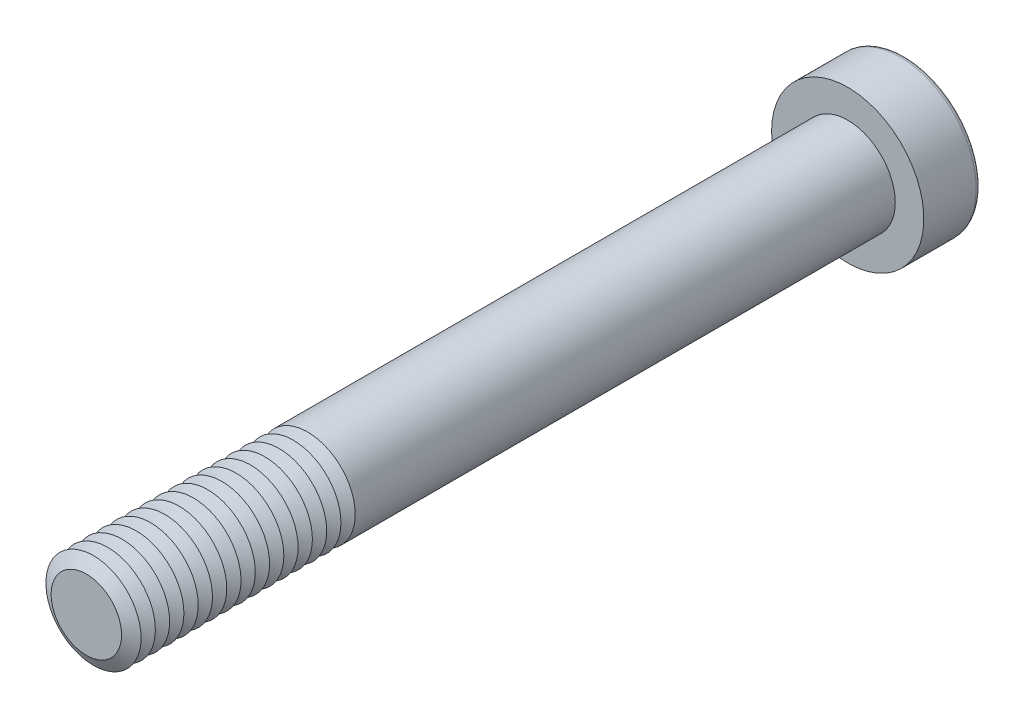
ISO-10303-21;
HEADER;
FILE_DESCRIPTION(('STEP AP214'),'2;1');
FILE_NAME('part.step','',(''),(''),'','','');
FILE_SCHEMA(('AUTOMOTIVE_DESIGN { 1 0 10303 214 1 1 1 1 }'));
ENDSEC;
DATA;
#1=APPLICATION_CONTEXT('core data for automotive mechanical design processes');
#2=APPLICATION_PROTOCOL_DEFINITION('international standard','automotive_design',2000,#1);
#3=PRODUCT_CONTEXT('',#1,'mechanical');
#4=PRODUCT('Part','Part','',(#3));
#5=PRODUCT_RELATED_PRODUCT_CATEGORY('part','',(#4));
#6=PRODUCT_DEFINITION_FORMATION('','',#4);
#7=PRODUCT_DEFINITION_CONTEXT('part definition',#1,'design');
#8=PRODUCT_DEFINITION('design','',#6,#7);
#9=PRODUCT_DEFINITION_SHAPE('','',#8);
#10=(LENGTH_UNIT() NAMED_UNIT(*) SI_UNIT(.MILLI.,.METRE.));
#11=(NAMED_UNIT(*) PLANE_ANGLE_UNIT() SI_UNIT($,.RADIAN.));
#12=(NAMED_UNIT(*) SI_UNIT($,.STERADIAN.) SOLID_ANGLE_UNIT());
#13=UNCERTAINTY_MEASURE_WITH_UNIT(LENGTH_MEASURE(1.E-05),#10,'distance_accuracy_value','');
#14=(GEOMETRIC_REPRESENTATION_CONTEXT(3) GLOBAL_UNCERTAINTY_ASSIGNED_CONTEXT((#13)) GLOBAL_UNIT_ASSIGNED_CONTEXT((#10,
#11,#12)) REPRESENTATION_CONTEXT('',''));
#15=CARTESIAN_POINT('',(0.,0.,0.));
#16=DIRECTION('',(0.,0.,1.));
#17=DIRECTION('',(1.,0.,0.));
#18=AXIS2_PLACEMENT_3D('',#15,#16,#17);
#19=CARTESIAN_POINT('',(0.,0.,74.75));
#20=DIRECTION('',(0.,0.,1.));
#21=DIRECTION('',(1.,0.,0.));
#22=AXIS2_PLACEMENT_3D('',#19,#20,#21);
#23=CONICAL_SURFACE('',#22,5.,1.0471975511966);
#24=CARTESIAN_POINT('',(0.,0.,74.));
#25=DIRECTION('',(0.,0.,1.));
#26=DIRECTION('',(1.,0.,0.));
#27=AXIS2_PLACEMENT_3D('',#24,#25,#26);
#28=CIRCLE('',#27,3.70096189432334);
#29=CARTESIAN_POINT('',(3.70096189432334,0.,74.));
#30=VERTEX_POINT('',#29);
#31=EDGE_CURVE('E314',#30,#30,#28,.T.);
#32=ORIENTED_EDGE('',*,*,#31,.T.);
#33=EDGE_LOOP('',(#32));
#34=FACE_BOUND('',#33,.T.);
#35=CARTESIAN_POINT('',(0.,0.,74.75));
#36=DIRECTION('',(0.,0.,1.));
#37=DIRECTION('',(1.,0.,0.));
#38=AXIS2_PLACEMENT_3D('',#35,#36,#37);
#39=CIRCLE('',#38,5.);
#40=CARTESIAN_POINT('',(5.,0.,74.75));
#41=VERTEX_POINT('',#40);
#42=EDGE_CURVE('E317',#41,#41,#39,.T.);
#43=ORIENTED_EDGE('',*,*,#42,.F.);
#44=EDGE_LOOP('',(#43));
#45=FACE_BOUND('',#44,.T.);
#46=ADVANCED_FACE('F39',(#34,#45),#23,.T.);
#47=CARTESIAN_POINT('',(0.,0.,74.));
#48=DIRECTION('',(0.,0.,-1.));
#49=DIRECTION('',(-1.,0.,0.));
#50=AXIS2_PLACEMENT_3D('',#47,#48,#49);
#51=CONICAL_SURFACE('',#50,3.70096189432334,1.0471975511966);
#52=CARTESIAN_POINT('',(0.,0.,73.25));
#53=DIRECTION('',(0.,0.,1.));
#54=DIRECTION('',(1.,0.,0.));
#55=AXIS2_PLACEMENT_3D('',#52,#53,#54);
#56=CIRCLE('',#55,5.);
#57=CARTESIAN_POINT('',(5.,0.,73.25));
#58=VERTEX_POINT('',#57);
#59=EDGE_CURVE('E325',#58,#58,#56,.T.);
#60=ORIENTED_EDGE('',*,*,#59,.T.);
#61=EDGE_LOOP('',(#60));
#62=FACE_BOUND('',#61,.T.);
#63=ORIENTED_EDGE('',*,*,#31,.F.);
#64=EDGE_LOOP('',(#63));
#65=FACE_BOUND('',#64,.T.);
#66=ADVANCED_FACE('F245',(#62,#65),#51,.T.);
#67=CARTESIAN_POINT('',(0.,0.,80.));
#68=DIRECTION('',(0.,0.,1.));
#69=DIRECTION('',(1.,0.,0.));
#70=AXIS2_PLACEMENT_3D('',#67,#68,#69);
#71=PLANE('',#70);
#72=CARTESIAN_POINT('',(0.,0.,80.));
#73=DIRECTION('',(0.,0.,1.));
#74=DIRECTION('',(1.,0.,0.));
#75=AXIS2_PLACEMENT_3D('',#72,#73,#74);
#76=CIRCLE('',#75,3.70096189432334);
#77=CARTESIAN_POINT('',(3.70096189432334,0.,80.));
#78=VERTEX_POINT('',#77);
#79=EDGE_CURVE('E174',#78,#78,#76,.T.);
#80=ORIENTED_EDGE('',*,*,#79,.T.);
#81=EDGE_LOOP('',(#80));
#82=FACE_BOUND('',#81,.T.);
#83=ADVANCED_FACE('F251',(#82),#71,.T.);
#84=CARTESIAN_POINT('',(0.,0.,80.));
#85=DIRECTION('',(0.,0.,-1.));
#86=DIRECTION('',(-1.,0.,0.));
#87=AXIS2_PLACEMENT_3D('',#84,#85,#86);
#88=CONICAL_SURFACE('',#87,3.70096189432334,1.0471975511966);
#89=CARTESIAN_POINT('',(0.,0.,79.25));
#90=DIRECTION('',(0.,0.,1.));
#91=DIRECTION('',(1.,0.,0.));
#92=AXIS2_PLACEMENT_3D('',#89,#90,#91);
#93=CIRCLE('',#92,5.);
#94=CARTESIAN_POINT('',(5.,0.,79.25));
#95=VERTEX_POINT('',#94);
#96=EDGE_CURVE('E291',#95,#95,#93,.T.);
#97=ORIENTED_EDGE('',*,*,#96,.T.);
#98=EDGE_LOOP('',(#97));
#99=FACE_BOUND('',#98,.T.);
#100=ORIENTED_EDGE('',*,*,#79,.F.);
#101=EDGE_LOOP('',(#100));
#102=FACE_BOUND('',#101,.T.);
#103=ADVANCED_FACE('F199',(#99,#102),#88,.T.);
#104=CARTESIAN_POINT('',(0.,0.,79.25));
#105=DIRECTION('',(0.,0.,1.));
#106=DIRECTION('',(1.,0.,0.));
#107=AXIS2_PLACEMENT_3D('',#104,#105,#106);
#108=CONICAL_SURFACE('',#107,5.,1.0471975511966);
#109=CARTESIAN_POINT('',(0.,0.,78.5));
#110=DIRECTION('',(0.,0.,1.));
#111=DIRECTION('',(1.,0.,0.));
#112=AXIS2_PLACEMENT_3D('',#109,#110,#111);
#113=CIRCLE('',#112,3.70096189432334);
#114=CARTESIAN_POINT('',(3.70096189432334,0.,78.5));
#115=VERTEX_POINT('',#114);
#116=EDGE_CURVE('E288',#115,#115,#113,.T.);
#117=ORIENTED_EDGE('',*,*,#116,.T.);
#118=EDGE_LOOP('',(#117));
#119=FACE_BOUND('',#118,.T.);
#120=ORIENTED_EDGE('',*,*,#96,.F.);
#121=EDGE_LOOP('',(#120));
#122=FACE_BOUND('',#121,.T.);
#123=ADVANCED_FACE('F277',(#119,#122),#108,.T.);
#124=CARTESIAN_POINT('',(0.,0.,78.5));
#125=DIRECTION('',(0.,0.,-1.));
#126=DIRECTION('',(-1.,0.,0.));
#127=AXIS2_PLACEMENT_3D('',#124,#125,#126);
#128=CONICAL_SURFACE('',#127,3.70096189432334,1.0471975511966);
#129=CARTESIAN_POINT('',(0.,0.,77.75));
#130=DIRECTION('',(0.,0.,1.));
#131=DIRECTION('',(1.,0.,0.));
#132=AXIS2_PLACEMENT_3D('',#129,#130,#131);
#133=CIRCLE('',#132,5.);
#134=CARTESIAN_POINT('',(5.,0.,77.75));
#135=VERTEX_POINT('',#134);
#136=EDGE_CURVE('E300',#135,#135,#133,.T.);
#137=ORIENTED_EDGE('',*,*,#136,.T.);
#138=EDGE_LOOP('',(#137));
#139=FACE_BOUND('',#138,.T.);
#140=ORIENTED_EDGE('',*,*,#116,.F.);
#141=EDGE_LOOP('',(#140));
#142=FACE_BOUND('',#141,.T.);
#143=ADVANCED_FACE('F274',(#139,#142),#128,.T.);
#144=CARTESIAN_POINT('',(0.,0.,77.75));
#145=DIRECTION('',(0.,0.,1.));
#146=DIRECTION('',(1.,0.,0.));
#147=AXIS2_PLACEMENT_3D('',#144,#145,#146);
#148=CONICAL_SURFACE('',#147,5.,1.0471975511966);
#149=CARTESIAN_POINT('',(0.,0.,77.));
#150=DIRECTION('',(0.,0.,1.));
#151=DIRECTION('',(1.,0.,0.));
#152=AXIS2_PLACEMENT_3D('',#149,#150,#151);
#153=CIRCLE('',#152,3.70096189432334);
#154=CARTESIAN_POINT('',(3.70096189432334,0.,77.));
#155=VERTEX_POINT('',#154);
#156=EDGE_CURVE('E293',#155,#155,#153,.T.);
#157=ORIENTED_EDGE('',*,*,#156,.T.);
#158=EDGE_LOOP('',(#157));
#159=FACE_BOUND('',#158,.T.);
#160=ORIENTED_EDGE('',*,*,#136,.F.);
#161=EDGE_LOOP('',(#160));
#162=FACE_BOUND('',#161,.T.);
#163=ADVANCED_FACE('F270',(#159,#162),#148,.T.);
#164=CARTESIAN_POINT('',(0.,0.,77.));
#165=DIRECTION('',(0.,0.,-1.));
#166=DIRECTION('',(-1.,0.,0.));
#167=AXIS2_PLACEMENT_3D('',#164,#165,#166);
#168=CONICAL_SURFACE('',#167,3.70096189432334,1.0471975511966);
#169=CARTESIAN_POINT('',(0.,0.,76.25));
#170=DIRECTION('',(0.,0.,1.));
#171=DIRECTION('',(1.,0.,0.));
#172=AXIS2_PLACEMENT_3D('',#169,#170,#171);
#173=CIRCLE('',#172,5.);
#174=CARTESIAN_POINT('',(5.,0.,76.25));
#175=VERTEX_POINT('',#174);
#176=EDGE_CURVE('E310',#175,#175,#173,.T.);
#177=ORIENTED_EDGE('',*,*,#176,.T.);
#178=EDGE_LOOP('',(#177));
#179=FACE_BOUND('',#178,.T.);
#180=ORIENTED_EDGE('',*,*,#156,.F.);
#181=EDGE_LOOP('',(#180));
#182=FACE_BOUND('',#181,.T.);
#183=ADVANCED_FACE('F266',(#179,#182),#168,.T.);
#184=CARTESIAN_POINT('',(0.,0.,76.25));
#185=DIRECTION('',(0.,0.,1.));
#186=DIRECTION('',(1.,0.,0.));
#187=AXIS2_PLACEMENT_3D('',#184,#185,#186);
#188=CONICAL_SURFACE('',#187,5.,1.0471975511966);
#189=CARTESIAN_POINT('',(0.,0.,75.5));
#190=DIRECTION('',(0.,0.,1.));
#191=DIRECTION('',(1.,0.,0.));
#192=AXIS2_PLACEMENT_3D('',#189,#190,#191);
#193=CIRCLE('',#192,3.70096189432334);
#194=CARTESIAN_POINT('',(3.70096189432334,0.,75.5));
#195=VERTEX_POINT('',#194);
#196=EDGE_CURVE('E306',#195,#195,#193,.T.);
#197=ORIENTED_EDGE('',*,*,#196,.T.);
#198=EDGE_LOOP('',(#197));
#199=FACE_BOUND('',#198,.T.);
#200=ORIENTED_EDGE('',*,*,#176,.F.);
#201=EDGE_LOOP('',(#200));
#202=FACE_BOUND('',#201,.T.);
#203=ADVANCED_FACE('F262',(#199,#202),#188,.T.);
#204=CARTESIAN_POINT('',(0.,0.,75.5));
#205=DIRECTION('',(0.,0.,-1.));
#206=DIRECTION('',(-1.,0.,0.));
#207=AXIS2_PLACEMENT_3D('',#204,#205,#206);
#208=CONICAL_SURFACE('',#207,3.70096189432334,1.0471975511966);
#209=ORIENTED_EDGE('',*,*,#42,.T.);
#210=EDGE_LOOP('',(#209));
#211=FACE_BOUND('',#210,.T.);
#212=ORIENTED_EDGE('',*,*,#196,.F.);
#213=EDGE_LOOP('',(#212));
#214=FACE_BOUND('',#213,.T.);
#215=ADVANCED_FACE('F258',(#211,#214),#208,.T.);
#216=CARTESIAN_POINT('',(0.,0.,73.25));
#217=DIRECTION('',(0.,0.,1.));
#218=DIRECTION('',(1.,0.,0.));
#219=AXIS2_PLACEMENT_3D('',#216,#217,#218);
#220=CONICAL_SURFACE('',#219,5.,1.0471975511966);
#221=CARTESIAN_POINT('',(0.,0.,72.5));
#222=DIRECTION('',(0.,0.,1.));
#223=DIRECTION('',(1.,0.,0.));
#224=AXIS2_PLACEMENT_3D('',#221,#222,#223);
#225=CIRCLE('',#224,3.70096189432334);
#226=CARTESIAN_POINT('',(3.70096189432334,0.,72.5));
#227=VERTEX_POINT('',#226);
#228=EDGE_CURVE('E321',#227,#227,#225,.T.);
#229=ORIENTED_EDGE('',*,*,#228,.T.);
#230=EDGE_LOOP('',(#229));
#231=FACE_BOUND('',#230,.T.);
#232=ORIENTED_EDGE('',*,*,#59,.F.);
#233=EDGE_LOOP('',(#232));
#234=FACE_BOUND('',#233,.T.);
#235=ADVANCED_FACE('F261',(#231,#234),#220,.T.);
#236=CARTESIAN_POINT('',(0.,0.,72.5));
#237=DIRECTION('',(0.,0.,-1.));
#238=DIRECTION('',(-1.,0.,0.));
#239=AXIS2_PLACEMENT_3D('',#236,#237,#238);
#240=CONICAL_SURFACE('',#239,3.70096189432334,1.0471975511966);
#241=CARTESIAN_POINT('',(0.,0.,71.75));
#242=DIRECTION('',(0.,0.,1.));
#243=DIRECTION('',(1.,0.,0.));
#244=AXIS2_PLACEMENT_3D('',#241,#242,#243);
#245=CIRCLE('',#244,5.);
#246=CARTESIAN_POINT('',(5.,0.,71.75));
#247=VERTEX_POINT('',#246);
#248=EDGE_CURVE('E332',#247,#247,#245,.T.);
#249=ORIENTED_EDGE('',*,*,#248,.T.);
#250=EDGE_LOOP('',(#249));
#251=FACE_BOUND('',#250,.T.);
#252=ORIENTED_EDGE('',*,*,#228,.F.);
#253=EDGE_LOOP('',(#252));
#254=FACE_BOUND('',#253,.T.);
#255=ADVANCED_FACE('F495',(#251,#254),#240,.T.);
#256=CARTESIAN_POINT('',(0.,0.,71.75));
#257=DIRECTION('',(0.,0.,1.));
#258=DIRECTION('',(1.,0.,0.));
#259=AXIS2_PLACEMENT_3D('',#256,#257,#258);
#260=CONICAL_SURFACE('',#259,5.,1.0471975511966);
#261=CARTESIAN_POINT('',(0.,0.,71.));
#262=DIRECTION('',(0.,0.,1.));
#263=DIRECTION('',(1.,0.,0.));
#264=AXIS2_PLACEMENT_3D('',#261,#262,#263);
#265=CIRCLE('',#264,3.70096189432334);
#266=CARTESIAN_POINT('',(3.70096189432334,0.,71.));
#267=VERTEX_POINT('',#266);
#268=EDGE_CURVE('E328',#267,#267,#265,.T.);
#269=ORIENTED_EDGE('',*,*,#268,.T.);
#270=EDGE_LOOP('',(#269));
#271=FACE_BOUND('',#270,.T.);
#272=ORIENTED_EDGE('',*,*,#248,.F.);
#273=EDGE_LOOP('',(#272));
#274=FACE_BOUND('',#273,.T.);
#275=ADVANCED_FACE('F491',(#271,#274),#260,.T.);
#276=CARTESIAN_POINT('',(0.,0.,71.));
#277=DIRECTION('',(0.,0.,-1.));
#278=DIRECTION('',(-1.,0.,0.));
#279=AXIS2_PLACEMENT_3D('',#276,#277,#278);
#280=CONICAL_SURFACE('',#279,3.70096189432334,1.0471975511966);
#281=CARTESIAN_POINT('',(0.,0.,70.25));
#282=DIRECTION('',(0.,0.,1.));
#283=DIRECTION('',(1.,0.,0.));
#284=AXIS2_PLACEMENT_3D('',#281,#282,#283);
#285=CIRCLE('',#284,5.);
#286=CARTESIAN_POINT('',(5.,0.,70.25));
#287=VERTEX_POINT('',#286);
#288=EDGE_CURVE('E340',#287,#287,#285,.T.);
#289=ORIENTED_EDGE('',*,*,#288,.T.);
#290=EDGE_LOOP('',(#289));
#291=FACE_BOUND('',#290,.T.);
#292=ORIENTED_EDGE('',*,*,#268,.F.);
#293=EDGE_LOOP('',(#292));
#294=FACE_BOUND('',#293,.T.);
#295=ADVANCED_FACE('F487',(#291,#294),#280,.T.);
#296=CARTESIAN_POINT('',(0.,0.,70.25));
#297=DIRECTION('',(0.,0.,1.));
#298=DIRECTION('',(1.,0.,0.));
#299=AXIS2_PLACEMENT_3D('',#296,#297,#298);
#300=CONICAL_SURFACE('',#299,5.,1.0471975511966);
#301=CARTESIAN_POINT('',(0.,0.,69.5));
#302=DIRECTION('',(0.,0.,1.));
#303=DIRECTION('',(1.,0.,0.));
#304=AXIS2_PLACEMENT_3D('',#301,#302,#303);
#305=CIRCLE('',#304,3.70096189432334);
#306=CARTESIAN_POINT('',(3.70096189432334,0.,69.5));
#307=VERTEX_POINT('',#306);
#308=EDGE_CURVE('E336',#307,#307,#305,.T.);
#309=ORIENTED_EDGE('',*,*,#308,.T.);
#310=EDGE_LOOP('',(#309));
#311=FACE_BOUND('',#310,.T.);
#312=ORIENTED_EDGE('',*,*,#288,.F.);
#313=EDGE_LOOP('',(#312));
#314=FACE_BOUND('',#313,.T.);
#315=ADVANCED_FACE('F483',(#311,#314),#300,.T.);
#316=CARTESIAN_POINT('',(0.,0.,69.5));
#317=DIRECTION('',(0.,0.,-1.));
#318=DIRECTION('',(-1.,0.,0.));
#319=AXIS2_PLACEMENT_3D('',#316,#317,#318);
#320=CONICAL_SURFACE('',#319,3.70096189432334,1.0471975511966);
#321=CARTESIAN_POINT('',(0.,0.,68.75));
#322=DIRECTION('',(0.,0.,1.));
#323=DIRECTION('',(1.,0.,0.));
#324=AXIS2_PLACEMENT_3D('',#321,#322,#323);
#325=CIRCLE('',#324,5.);
#326=CARTESIAN_POINT('',(5.,0.,68.75));
#327=VERTEX_POINT('',#326);
#328=EDGE_CURVE('E348',#327,#327,#325,.T.);
#329=ORIENTED_EDGE('',*,*,#328,.T.);
#330=EDGE_LOOP('',(#329));
#331=FACE_BOUND('',#330,.T.);
#332=ORIENTED_EDGE('',*,*,#308,.F.);
#333=EDGE_LOOP('',(#332));
#334=FACE_BOUND('',#333,.T.);
#335=ADVANCED_FACE('F479',(#331,#334),#320,.T.);
#336=CARTESIAN_POINT('',(0.,0.,68.75));
#337=DIRECTION('',(0.,0.,1.));
#338=DIRECTION('',(1.,0.,0.));
#339=AXIS2_PLACEMENT_3D('',#336,#337,#338);
#340=CONICAL_SURFACE('',#339,5.,1.0471975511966);
#341=CARTESIAN_POINT('',(0.,0.,68.));
#342=DIRECTION('',(0.,0.,1.));
#343=DIRECTION('',(1.,0.,0.));
#344=AXIS2_PLACEMENT_3D('',#341,#342,#343);
#345=CIRCLE('',#344,3.70096189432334);
#346=CARTESIAN_POINT('',(3.70096189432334,0.,68.));
#347=VERTEX_POINT('',#346);
#348=EDGE_CURVE('E344',#347,#347,#345,.T.);
#349=ORIENTED_EDGE('',*,*,#348,.T.);
#350=EDGE_LOOP('',(#349));
#351=FACE_BOUND('',#350,.T.);
#352=ORIENTED_EDGE('',*,*,#328,.F.);
#353=EDGE_LOOP('',(#352));
#354=FACE_BOUND('',#353,.T.);
#355=ADVANCED_FACE('F475',(#351,#354),#340,.T.);
#356=CARTESIAN_POINT('',(0.,0.,68.));
#357=DIRECTION('',(0.,0.,-1.));
#358=DIRECTION('',(-1.,0.,0.));
#359=AXIS2_PLACEMENT_3D('',#356,#357,#358);
#360=CONICAL_SURFACE('',#359,3.70096189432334,1.0471975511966);
#361=CARTESIAN_POINT('',(0.,0.,67.25));
#362=DIRECTION('',(0.,0.,1.));
#363=DIRECTION('',(1.,0.,0.));
#364=AXIS2_PLACEMENT_3D('',#361,#362,#363);
#365=CIRCLE('',#364,5.);
#366=CARTESIAN_POINT('',(5.,0.,67.25));
#367=VERTEX_POINT('',#366);
#368=EDGE_CURVE('E356',#367,#367,#365,.T.);
#369=ORIENTED_EDGE('',*,*,#368,.T.);
#370=EDGE_LOOP('',(#369));
#371=FACE_BOUND('',#370,.T.);
#372=ORIENTED_EDGE('',*,*,#348,.F.);
#373=EDGE_LOOP('',(#372));
#374=FACE_BOUND('',#373,.T.);
#375=ADVANCED_FACE('F471',(#371,#374),#360,.T.);
#376=CARTESIAN_POINT('',(0.,0.,67.25));
#377=DIRECTION('',(0.,0.,1.));
#378=DIRECTION('',(1.,0.,0.));
#379=AXIS2_PLACEMENT_3D('',#376,#377,#378);
#380=CONICAL_SURFACE('',#379,5.,1.0471975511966);
#381=CARTESIAN_POINT('',(0.,0.,66.5));
#382=DIRECTION('',(0.,0.,1.));
#383=DIRECTION('',(1.,0.,0.));
#384=AXIS2_PLACEMENT_3D('',#381,#382,#383);
#385=CIRCLE('',#384,3.70096189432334);
#386=CARTESIAN_POINT('',(3.70096189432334,0.,66.5));
#387=VERTEX_POINT('',#386);
#388=EDGE_CURVE('E352',#387,#387,#385,.T.);
#389=ORIENTED_EDGE('',*,*,#388,.T.);
#390=EDGE_LOOP('',(#389));
#391=FACE_BOUND('',#390,.T.);
#392=ORIENTED_EDGE('',*,*,#368,.F.);
#393=EDGE_LOOP('',(#392));
#394=FACE_BOUND('',#393,.T.);
#395=ADVANCED_FACE('F467',(#391,#394),#380,.T.);
#396=CARTESIAN_POINT('',(0.,0.,66.5));
#397=DIRECTION('',(0.,0.,-1.));
#398=DIRECTION('',(-1.,0.,0.));
#399=AXIS2_PLACEMENT_3D('',#396,#397,#398);
#400=CONICAL_SURFACE('',#399,3.70096189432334,1.0471975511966);
#401=CARTESIAN_POINT('',(0.,0.,65.75));
#402=DIRECTION('',(0.,0.,1.));
#403=DIRECTION('',(1.,0.,0.));
#404=AXIS2_PLACEMENT_3D('',#401,#402,#403);
#405=CIRCLE('',#404,5.);
#406=CARTESIAN_POINT('',(5.,0.,65.75));
#407=VERTEX_POINT('',#406);
#408=EDGE_CURVE('E364',#407,#407,#405,.T.);
#409=ORIENTED_EDGE('',*,*,#408,.T.);
#410=EDGE_LOOP('',(#409));
#411=FACE_BOUND('',#410,.T.);
#412=ORIENTED_EDGE('',*,*,#388,.F.);
#413=EDGE_LOOP('',(#412));
#414=FACE_BOUND('',#413,.T.);
#415=ADVANCED_FACE('F463',(#411,#414),#400,.T.);
#416=CARTESIAN_POINT('',(0.,0.,65.75));
#417=DIRECTION('',(0.,0.,1.));
#418=DIRECTION('',(1.,0.,0.));
#419=AXIS2_PLACEMENT_3D('',#416,#417,#418);
#420=CONICAL_SURFACE('',#419,5.,1.0471975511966);
#421=CARTESIAN_POINT('',(0.,0.,65.));
#422=DIRECTION('',(0.,0.,1.));
#423=DIRECTION('',(1.,0.,0.));
#424=AXIS2_PLACEMENT_3D('',#421,#422,#423);
#425=CIRCLE('',#424,3.70096189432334);
#426=CARTESIAN_POINT('',(3.70096189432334,0.,65.));
#427=VERTEX_POINT('',#426);
#428=EDGE_CURVE('E360',#427,#427,#425,.T.);
#429=ORIENTED_EDGE('',*,*,#428,.T.);
#430=EDGE_LOOP('',(#429));
#431=FACE_BOUND('',#430,.T.);
#432=ORIENTED_EDGE('',*,*,#408,.F.);
#433=EDGE_LOOP('',(#432));
#434=FACE_BOUND('',#433,.T.);
#435=ADVANCED_FACE('F459',(#431,#434),#420,.T.);
#436=CARTESIAN_POINT('',(0.,0.,65.));
#437=DIRECTION('',(0.,0.,-1.));
#438=DIRECTION('',(-1.,0.,0.));
#439=AXIS2_PLACEMENT_3D('',#436,#437,#438);
#440=CONICAL_SURFACE('',#439,3.70096189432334,1.0471975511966);
#441=CARTESIAN_POINT('',(0.,0.,64.25));
#442=DIRECTION('',(0.,0.,1.));
#443=DIRECTION('',(1.,0.,0.));
#444=AXIS2_PLACEMENT_3D('',#441,#442,#443);
#445=CIRCLE('',#444,5.);
#446=CARTESIAN_POINT('',(5.,0.,64.25));
#447=VERTEX_POINT('',#446);
#448=EDGE_CURVE('E372',#447,#447,#445,.T.);
#449=ORIENTED_EDGE('',*,*,#448,.T.);
#450=EDGE_LOOP('',(#449));
#451=FACE_BOUND('',#450,.T.);
#452=ORIENTED_EDGE('',*,*,#428,.F.);
#453=EDGE_LOOP('',(#452));
#454=FACE_BOUND('',#453,.T.);
#455=ADVANCED_FACE('F455',(#451,#454),#440,.T.);
#456=CARTESIAN_POINT('',(0.,0.,64.25));
#457=DIRECTION('',(0.,0.,1.));
#458=DIRECTION('',(1.,0.,0.));
#459=AXIS2_PLACEMENT_3D('',#456,#457,#458);
#460=CONICAL_SURFACE('',#459,5.,1.0471975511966);
#461=CARTESIAN_POINT('',(0.,0.,63.5));
#462=DIRECTION('',(0.,0.,1.));
#463=DIRECTION('',(1.,0.,0.));
#464=AXIS2_PLACEMENT_3D('',#461,#462,#463);
#465=CIRCLE('',#464,3.70096189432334);
#466=CARTESIAN_POINT('',(3.70096189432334,0.,63.5));
#467=VERTEX_POINT('',#466);
#468=EDGE_CURVE('E368',#467,#467,#465,.T.);
#469=ORIENTED_EDGE('',*,*,#468,.T.);
#470=EDGE_LOOP('',(#469));
#471=FACE_BOUND('',#470,.T.);
#472=ORIENTED_EDGE('',*,*,#448,.F.);
#473=EDGE_LOOP('',(#472));
#474=FACE_BOUND('',#473,.T.);
#475=ADVANCED_FACE('F451',(#471,#474),#460,.T.);
#476=CARTESIAN_POINT('',(0.,0.,63.5));
#477=DIRECTION('',(0.,0.,-1.));
#478=DIRECTION('',(-1.,0.,0.));
#479=AXIS2_PLACEMENT_3D('',#476,#477,#478);
#480=CONICAL_SURFACE('',#479,3.70096189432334,1.0471975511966);
#481=CARTESIAN_POINT('',(0.,0.,62.75));
#482=DIRECTION('',(0.,0.,1.));
#483=DIRECTION('',(1.,0.,0.));
#484=AXIS2_PLACEMENT_3D('',#481,#482,#483);
#485=CIRCLE('',#484,5.);
#486=CARTESIAN_POINT('',(5.,0.,62.75));
#487=VERTEX_POINT('',#486);
#488=EDGE_CURVE('E380',#487,#487,#485,.T.);
#489=ORIENTED_EDGE('',*,*,#488,.T.);
#490=EDGE_LOOP('',(#489));
#491=FACE_BOUND('',#490,.T.);
#492=ORIENTED_EDGE('',*,*,#468,.F.);
#493=EDGE_LOOP('',(#492));
#494=FACE_BOUND('',#493,.T.);
#495=ADVANCED_FACE('F447',(#491,#494),#480,.T.);
#496=CARTESIAN_POINT('',(0.,0.,62.75));
#497=DIRECTION('',(0.,0.,1.));
#498=DIRECTION('',(1.,0.,0.));
#499=AXIS2_PLACEMENT_3D('',#496,#497,#498);
#500=CONICAL_SURFACE('',#499,5.,1.0471975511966);
#501=CARTESIAN_POINT('',(0.,0.,62.));
#502=DIRECTION('',(0.,0.,1.));
#503=DIRECTION('',(1.,0.,0.));
#504=AXIS2_PLACEMENT_3D('',#501,#502,#503);
#505=CIRCLE('',#504,3.70096189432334);
#506=CARTESIAN_POINT('',(3.70096189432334,0.,62.));
#507=VERTEX_POINT('',#506);
#508=EDGE_CURVE('E376',#507,#507,#505,.T.);
#509=ORIENTED_EDGE('',*,*,#508,.T.);
#510=EDGE_LOOP('',(#509));
#511=FACE_BOUND('',#510,.T.);
#512=ORIENTED_EDGE('',*,*,#488,.F.);
#513=EDGE_LOOP('',(#512));
#514=FACE_BOUND('',#513,.T.);
#515=ADVANCED_FACE('F443',(#511,#514),#500,.T.);
#516=CARTESIAN_POINT('',(0.,0.,62.));
#517=DIRECTION('',(0.,0.,-1.));
#518=DIRECTION('',(-1.,0.,0.));
#519=AXIS2_PLACEMENT_3D('',#516,#517,#518);
#520=CONICAL_SURFACE('',#519,3.70096189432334,1.0471975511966);
#521=CARTESIAN_POINT('',(0.,0.,61.25));
#522=DIRECTION('',(0.,0.,1.));
#523=DIRECTION('',(1.,0.,0.));
#524=AXIS2_PLACEMENT_3D('',#521,#522,#523);
#525=CIRCLE('',#524,5.);
#526=CARTESIAN_POINT('',(5.,0.,61.25));
#527=VERTEX_POINT('',#526);
#528=EDGE_CURVE('E388',#527,#527,#525,.T.);
#529=ORIENTED_EDGE('',*,*,#528,.T.);
#530=EDGE_LOOP('',(#529));
#531=FACE_BOUND('',#530,.T.);
#532=ORIENTED_EDGE('',*,*,#508,.F.);
#533=EDGE_LOOP('',(#532));
#534=FACE_BOUND('',#533,.T.);
#535=ADVANCED_FACE('F439',(#531,#534),#520,.T.);
#536=CARTESIAN_POINT('',(0.,0.,61.25));
#537=DIRECTION('',(0.,0.,1.));
#538=DIRECTION('',(1.,0.,0.));
#539=AXIS2_PLACEMENT_3D('',#536,#537,#538);
#540=CONICAL_SURFACE('',#539,5.,1.0471975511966);
#541=CARTESIAN_POINT('',(0.,0.,60.5));
#542=DIRECTION('',(0.,0.,1.));
#543=DIRECTION('',(1.,0.,0.));
#544=AXIS2_PLACEMENT_3D('',#541,#542,#543);
#545=CIRCLE('',#544,3.70096189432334);
#546=CARTESIAN_POINT('',(3.70096189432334,0.,60.5));
#547=VERTEX_POINT('',#546);
#548=EDGE_CURVE('E384',#547,#547,#545,.T.);
#549=ORIENTED_EDGE('',*,*,#548,.T.);
#550=EDGE_LOOP('',(#549));
#551=FACE_BOUND('',#550,.T.);
#552=ORIENTED_EDGE('',*,*,#528,.F.);
#553=EDGE_LOOP('',(#552));
#554=FACE_BOUND('',#553,.T.);
#555=ADVANCED_FACE('F435',(#551,#554),#540,.T.);
#556=CARTESIAN_POINT('',(0.,0.,60.5));
#557=DIRECTION('',(0.,0.,-1.));
#558=DIRECTION('',(-1.,0.,0.));
#559=AXIS2_PLACEMENT_3D('',#556,#557,#558);
#560=CONICAL_SURFACE('',#559,3.70096189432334,1.0471975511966);
#561=CARTESIAN_POINT('',(0.,0.,59.75));
#562=DIRECTION('',(0.,0.,1.));
#563=DIRECTION('',(1.,0.,0.));
#564=AXIS2_PLACEMENT_3D('',#561,#562,#563);
#565=CIRCLE('',#564,5.);
#566=CARTESIAN_POINT('',(5.,0.,59.75));
#567=VERTEX_POINT('',#566);
#568=EDGE_CURVE('E395',#567,#567,#565,.T.);
#569=ORIENTED_EDGE('',*,*,#568,.T.);
#570=EDGE_LOOP('',(#569));
#571=FACE_BOUND('',#570,.T.);
#572=ORIENTED_EDGE('',*,*,#548,.F.);
#573=EDGE_LOOP('',(#572));
#574=FACE_BOUND('',#573,.T.);
#575=ADVANCED_FACE('F431',(#571,#574),#560,.T.);
#576=CARTESIAN_POINT('',(0.,0.,59.75));
#577=DIRECTION('',(0.,0.,1.));
#578=DIRECTION('',(1.,0.,0.));
#579=AXIS2_PLACEMENT_3D('',#576,#577,#578);
#580=CONICAL_SURFACE('',#579,5.,1.0471975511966);
#581=CARTESIAN_POINT('',(0.,0.,59.));
#582=DIRECTION('',(0.,0.,1.));
#583=DIRECTION('',(1.,0.,0.));
#584=AXIS2_PLACEMENT_3D('',#581,#582,#583);
#585=CIRCLE('',#584,3.70096189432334);
#586=CARTESIAN_POINT('',(3.70096189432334,0.,59.));
#587=VERTEX_POINT('',#586);
#588=EDGE_CURVE('E391',#587,#587,#585,.T.);
#589=ORIENTED_EDGE('',*,*,#588,.T.);
#590=EDGE_LOOP('',(#589));
#591=FACE_BOUND('',#590,.T.);
#592=ORIENTED_EDGE('',*,*,#568,.F.);
#593=EDGE_LOOP('',(#592));
#594=FACE_BOUND('',#593,.T.);
#595=ADVANCED_FACE('F426',(#591,#594),#580,.T.);
#596=CARTESIAN_POINT('',(0.,0.,59.));
#597=DIRECTION('',(0.,0.,-1.));
#598=DIRECTION('',(-1.,0.,0.));
#599=AXIS2_PLACEMENT_3D('',#596,#597,#598);
#600=CONICAL_SURFACE('',#599,3.70096189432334,1.0471975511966);
#601=CARTESIAN_POINT('',(0.,0.,58.25));
#602=DIRECTION('',(0.,0.,1.));
#603=DIRECTION('',(1.,0.,0.));
#604=AXIS2_PLACEMENT_3D('',#601,#602,#603);
#605=CIRCLE('',#604,5.);
#606=CARTESIAN_POINT('',(5.,0.,58.25));
#607=VERTEX_POINT('',#606);
#608=EDGE_CURVE('E407',#607,#607,#605,.T.);
#609=ORIENTED_EDGE('',*,*,#608,.T.);
#610=EDGE_LOOP('',(#609));
#611=FACE_BOUND('',#610,.T.);
#612=ORIENTED_EDGE('',*,*,#588,.F.);
#613=EDGE_LOOP('',(#612));
#614=FACE_BOUND('',#613,.T.);
#615=ADVANCED_FACE('F412',(#611,#614),#600,.T.);
#616=CARTESIAN_POINT('',(0.,0.,58.25));
#617=DIRECTION('',(0.,0.,1.));
#618=DIRECTION('',(1.,0.,0.));
#619=AXIS2_PLACEMENT_3D('',#616,#617,#618);
#620=CONICAL_SURFACE('',#619,5.,1.0471975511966);
#621=CARTESIAN_POINT('',(0.,0.,57.5));
#622=DIRECTION('',(0.,0.,1.));
#623=DIRECTION('',(1.,0.,0.));
#624=AXIS2_PLACEMENT_3D('',#621,#622,#623);
#625=CIRCLE('',#624,3.70096189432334);
#626=CARTESIAN_POINT('',(3.70096189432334,0.,57.5));
#627=VERTEX_POINT('',#626);
#628=EDGE_CURVE('E399',#627,#627,#625,.T.);
#629=ORIENTED_EDGE('',*,*,#628,.T.);
#630=EDGE_LOOP('',(#629));
#631=FACE_BOUND('',#630,.T.);
#632=ORIENTED_EDGE('',*,*,#608,.F.);
#633=EDGE_LOOP('',(#632));
#634=FACE_BOUND('',#633,.T.);
#635=ADVANCED_FACE('F415',(#631,#634),#620,.T.);
#636=CARTESIAN_POINT('',(0.,0.,57.5));
#637=DIRECTION('',(0.,0.,-1.));
#638=DIRECTION('',(-1.,0.,0.));
#639=AXIS2_PLACEMENT_3D('',#636,#637,#638);
#640=CONICAL_SURFACE('',#639,3.70096189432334,1.0471975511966);
#641=CARTESIAN_POINT('',(0.,0.,56.75));
#642=DIRECTION('',(0.,0.,1.));
#643=DIRECTION('',(1.,0.,0.));
#644=AXIS2_PLACEMENT_3D('',#641,#642,#643);
#645=CIRCLE('',#644,5.);
#646=CARTESIAN_POINT('',(5.,0.,56.75));
#647=VERTEX_POINT('',#646);
#648=EDGE_CURVE('E403',#647,#647,#645,.T.);
#649=ORIENTED_EDGE('',*,*,#648,.T.);
#650=EDGE_LOOP('',(#649));
#651=FACE_BOUND('',#650,.T.);
#652=ORIENTED_EDGE('',*,*,#628,.F.);
#653=EDGE_LOOP('',(#652));
#654=FACE_BOUND('',#653,.T.);
#655=ADVANCED_FACE('F417',(#651,#654),#640,.T.);
#656=CARTESIAN_POINT('',(0.,0.,-0.75));
#657=DIRECTION('',(0.,0.,-1.));
#658=DIRECTION('',(-1.,0.,0.));
#659=AXIS2_PLACEMENT_3D('',#656,#657,#658);
#660=CONICAL_SURFACE('',#659,3.5,1.0471975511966);
#661=CARTESIAN_POINT('',(0.,0.,1.27072594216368));
#662=VERTEX_POINT('',#661);
#663=VERTEX_LOOP('',#662);
#664=FACE_BOUND('',#663,.T.);
#665=CARTESIAN_POINT('',(0.,0.,-0.75));
#666=DIRECTION('',(0.,0.,-1.));
#667=DIRECTION('',(-1.,0.,0.));
#668=AXIS2_PLACEMENT_3D('',#665,#666,#667);
#669=CIRCLE('',#668,3.5);
#670=CARTESIAN_POINT('',(-3.03108891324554,1.75,-0.75));
#671=VERTEX_POINT('',#670);
#672=CARTESIAN_POINT('',(0.,3.5,-0.75));
#673=VERTEX_POINT('',#672);
#674=EDGE_CURVE('E149',#671,#673,#669,.T.);
#675=ORIENTED_EDGE('',*,*,#674,.T.);
#676=CARTESIAN_POINT('',(0.,0.,-0.75));
#677=DIRECTION('',(0.,0.,-1.));
#678=DIRECTION('',(-1.,0.,0.));
#679=AXIS2_PLACEMENT_3D('',#676,#677,#678);
#680=CIRCLE('',#679,3.5);
#681=CARTESIAN_POINT('',(3.03108891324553,1.75,-0.75));
#682=VERTEX_POINT('',#681);
#683=EDGE_CURVE('E54',#673,#682,#680,.T.);
#684=ORIENTED_EDGE('',*,*,#683,.T.);
#685=CARTESIAN_POINT('',(3.03108891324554,-1.75,-0.75));
#686=VERTEX_POINT('',#685);
#687=EDGE_CURVE('E996',#682,#686,#680,.T.);
#688=ORIENTED_EDGE('',*,*,#687,.T.);
#689=CARTESIAN_POINT('',(0.,-3.5,-0.75));
#690=VERTEX_POINT('',#689);
#691=EDGE_CURVE('E994',#686,#690,#680,.T.);
#692=ORIENTED_EDGE('',*,*,#691,.T.);
#693=CARTESIAN_POINT('',(-3.03108891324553,-1.75,-0.75));
#694=VERTEX_POINT('',#693);
#695=EDGE_CURVE('E988',#690,#694,#680,.T.);
#696=ORIENTED_EDGE('',*,*,#695,.T.);
#697=EDGE_CURVE('E986',#694,#671,#680,.T.);
#698=ORIENTED_EDGE('',*,*,#697,.T.);
#699=EDGE_LOOP('',(#675,#684,#688,#692,#696,#698));
#700=FACE_BOUND('',#699,.T.);
#701=ADVANCED_FACE('F201',(#664,#700),#660,.F.);
#702=CARTESIAN_POINT('',(0.,0.,-0.75));
#703=DIRECTION('',(0.,0.,-1.));
#704=DIRECTION('',(-1.,0.,0.));
#705=AXIS2_PLACEMENT_3D('',#702,#703,#704);
#706=PLANE('',#705);
#707=ORIENTED_EDGE('',*,*,#683,.F.);
#708=DIRECTION('',(1.,0.,0.));
#709=VECTOR('',#708,1.);
#710=CARTESIAN_POINT('',(-2.02072594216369,3.5,-0.75));
#711=LINE('',#710,#709);
#712=CARTESIAN_POINT('',(2.02072594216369,3.5,-0.75));
#713=VERTEX_POINT('',#712);
#714=EDGE_CURVE('E1036',#673,#713,#711,.T.);
#715=ORIENTED_EDGE('',*,*,#714,.T.);
#716=DIRECTION('',(0.5,-0.866025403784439,0.));
#717=VECTOR('',#716,1.);
#718=CARTESIAN_POINT('',(2.02072594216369,3.5,-0.75));
#719=LINE('',#718,#717);
#720=EDGE_CURVE('E155',#713,#682,#719,.T.);
#721=ORIENTED_EDGE('',*,*,#720,.T.);
#722=EDGE_LOOP('',(#707,#715,#721));
#723=FACE_BOUND('',#722,.T.);
#724=ADVANCED_FACE('F584',(#723),#706,.T.);
#725=ORIENTED_EDGE('',*,*,#687,.F.);
#726=CARTESIAN_POINT('',(4.04145188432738,0.,-0.75));
#727=VERTEX_POINT('',#726);
#728=EDGE_CURVE('E1035',#682,#727,#719,.T.);
#729=ORIENTED_EDGE('',*,*,#728,.T.);
#730=DIRECTION('',(-0.5,-0.866025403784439,0.));
#731=VECTOR('',#730,1.);
#732=CARTESIAN_POINT('',(4.04145188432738,0.,-0.75));
#733=LINE('',#732,#731);
#734=EDGE_CURVE('E1009',#727,#686,#733,.T.);
#735=ORIENTED_EDGE('',*,*,#734,.T.);
#736=EDGE_LOOP('',(#725,#729,#735));
#737=FACE_BOUND('',#736,.T.);
#738=ADVANCED_FACE('F594',(#737),#706,.T.);
#739=ORIENTED_EDGE('',*,*,#691,.F.);
#740=CARTESIAN_POINT('',(2.02072594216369,-3.5,-0.75));
#741=VERTEX_POINT('',#740);
#742=EDGE_CURVE('E1011',#686,#741,#733,.T.);
#743=ORIENTED_EDGE('',*,*,#742,.T.);
#744=DIRECTION('',(-1.,0.,0.));
#745=VECTOR('',#744,1.);
#746=CARTESIAN_POINT('',(2.02072594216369,-3.5,-0.75));
#747=LINE('',#746,#745);
#748=EDGE_CURVE('E960',#741,#690,#747,.T.);
#749=ORIENTED_EDGE('',*,*,#748,.T.);
#750=EDGE_LOOP('',(#739,#743,#749));
#751=FACE_BOUND('',#750,.T.);
#752=ADVANCED_FACE('F604',(#751),#706,.T.);
#753=ORIENTED_EDGE('',*,*,#695,.F.);
#754=CARTESIAN_POINT('',(-2.02072594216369,-3.5,-0.75));
#755=VERTEX_POINT('',#754);
#756=EDGE_CURVE('E1005',#690,#755,#747,.T.);
#757=ORIENTED_EDGE('',*,*,#756,.T.);
#758=DIRECTION('',(-0.5,0.866025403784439,0.));
#759=VECTOR('',#758,1.);
#760=CARTESIAN_POINT('',(-2.02072594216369,-3.5,-0.75));
#761=LINE('',#760,#759);
#762=EDGE_CURVE('E1007',#755,#694,#761,.T.);
#763=ORIENTED_EDGE('',*,*,#762,.T.);
#764=EDGE_LOOP('',(#753,#757,#763));
#765=FACE_BOUND('',#764,.T.);
#766=ADVANCED_FACE('F612',(#765),#706,.T.);
#767=ORIENTED_EDGE('',*,*,#697,.F.);
#768=CARTESIAN_POINT('',(-4.04145188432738,0.,-0.75));
#769=VERTEX_POINT('',#768);
#770=EDGE_CURVE('E1012',#694,#769,#761,.T.);
#771=ORIENTED_EDGE('',*,*,#770,.T.);
#772=DIRECTION('',(0.5,0.866025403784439,0.));
#773=VECTOR('',#772,1.);
#774=CARTESIAN_POINT('',(-4.04145188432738,0.,-0.75));
#775=LINE('',#774,#773);
#776=EDGE_CURVE('E158',#769,#671,#775,.T.);
#777=ORIENTED_EDGE('',*,*,#776,.T.);
#778=EDGE_LOOP('',(#767,#771,#777));
#779=FACE_BOUND('',#778,.T.);
#780=ADVANCED_FACE('F231',(#779),#706,.T.);
#781=ORIENTED_EDGE('',*,*,#674,.F.);
#782=CARTESIAN_POINT('',(-2.02072594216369,3.5,-0.75));
#783=VERTEX_POINT('',#782);
#784=EDGE_CURVE('E1019',#671,#783,#775,.T.);
#785=ORIENTED_EDGE('',*,*,#784,.T.);
#786=EDGE_CURVE('E1033',#783,#673,#711,.T.);
#787=ORIENTED_EDGE('',*,*,#786,.T.);
#788=EDGE_LOOP('',(#781,#785,#787));
#789=FACE_BOUND('',#788,.T.);
#790=ADVANCED_FACE('F596',(#789),#706,.T.);
#791=CARTESIAN_POINT('',(-2.02072594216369,3.5,-0.75));
#792=DIRECTION('',(0.,1.,0.));
#793=DIRECTION('',(-1.,0.,0.));
#794=AXIS2_PLACEMENT_3D('',#791,#792,#793);
#795=PLANE('',#794);
#796=DIRECTION('',(0.,0.,-1.));
#797=VECTOR('',#796,1.);
#798=CARTESIAN_POINT('',(-2.02072594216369,3.5,-0.75));
#799=LINE('',#798,#797);
#800=CARTESIAN_POINT('',(-2.02072594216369,3.5,-6.));
#801=VERTEX_POINT('',#800);
#802=EDGE_CURVE('E147',#783,#801,#799,.T.);
#803=ORIENTED_EDGE('',*,*,#802,.T.);
#804=CARTESIAN_POINT('',(-5.27521327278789,3.5,-6.613404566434));
#805=CARTESIAN_POINT('',(-5.11717138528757,3.5,-6.57812703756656));
#806=CARTESIAN_POINT('',(-4.95902873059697,3.5,-6.5432936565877));
#807=CARTESIAN_POINT('',(-4.64249233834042,3.5,-6.47475322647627));
#808=CARTESIAN_POINT('',(-4.48409858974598,3.5,-6.44104622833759));
#809=CARTESIAN_POINT('',(-4.16686075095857,3.5,-6.37496567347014));
#810=CARTESIAN_POINT('',(-4.00801636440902,3.5,-6.34259353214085));
#811=CARTESIAN_POINT('',(-3.68999232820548,3.5,-6.27954992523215));
#812=CARTESIAN_POINT('',(-3.53081268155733,3.5,-6.24887844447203));
#813=CARTESIAN_POINT('',(-3.05545711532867,3.5,-6.16049717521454));
#814=CARTESIAN_POINT('',(-2.73870333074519,3.5,-6.10583257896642));
#815=CARTESIAN_POINT('',(-2.10326379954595,3.5,-6.00899390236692));
#816=CARTESIAN_POINT('',(-1.78457845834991,3.5,-5.9668172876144));
#817=CARTESIAN_POINT('',(-1.30331397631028,3.5,-5.91703310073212));
#818=CARTESIAN_POINT('',(-1.14143900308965,3.5,-5.90264327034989));
#819=CARTESIAN_POINT('',(-0.817296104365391,3.5,-5.87924021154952));
#820=CARTESIAN_POINT('',(-0.655028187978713,3.5,-5.87022685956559));
#821=CARTESIAN_POINT('',(-0.330337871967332,3.5,-5.8581019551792));
#822=CARTESIAN_POINT('',(-0.167915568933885,3.5,-5.85498786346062));
#823=CARTESIAN_POINT('',(0.156931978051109,3.5,-5.85485125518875));
#824=CARTESIAN_POINT('',(0.319357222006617,3.5,-5.8578287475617));
#825=CARTESIAN_POINT('',(0.644649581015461,3.5,-5.86971076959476));
#826=CARTESIAN_POINT('',(0.807515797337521,3.5,-5.87863941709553));
#827=CARTESIAN_POINT('',(1.13286152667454,3.5,-5.90192432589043));
#828=CARTESIAN_POINT('',(1.29534101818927,3.5,-5.91628088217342));
#829=CARTESIAN_POINT('',(1.61990955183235,3.5,-5.94971371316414));
#830=CARTESIAN_POINT('',(1.78199828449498,3.5,-5.96879294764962));
#831=CARTESIAN_POINT('',(2.10565606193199,3.5,-6.01089893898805));
#832=CARTESIAN_POINT('',(2.26722510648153,3.5,-6.03392569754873));
#833=CARTESIAN_POINT('',(2.59408673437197,3.5,-6.08385328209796));
#834=CARTESIAN_POINT('',(2.75936612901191,3.5,-6.11083971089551));
#835=CARTESIAN_POINT('',(3.08945524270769,3.5,-6.16755337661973));
#836=CARTESIAN_POINT('',(3.25426494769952,3.5,-6.19728069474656));
#837=CARTESIAN_POINT('',(3.74811783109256,3.5,-6.28973245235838));
#838=CARTESIAN_POINT('',(4.07654810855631,3.5,-6.35572082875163));
#839=CARTESIAN_POINT('',(4.73230999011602,3.5,-6.49329874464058));
#840=CARTESIAN_POINT('',(5.05964125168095,3.5,-6.56488988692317));
#841=CARTESIAN_POINT('',(5.71347161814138,3.5,-6.71179760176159));
#842=CARTESIAN_POINT('',(6.03997070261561,3.5,-6.78711426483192));
#843=CARTESIAN_POINT('',(6.68838444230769,3.5,-6.93936666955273));
#844=CARTESIAN_POINT('',(7.01030641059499,3.5,-7.01627142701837));
#845=CARTESIAN_POINT('',(7.65372712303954,3.5,-7.17185944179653));
#846=CARTESIAN_POINT('',(7.97522585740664,3.5,-7.25054273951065));
#847=CARTESIAN_POINT('',(8.61745492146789,3.5,-7.409094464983));
#848=CARTESIAN_POINT('',(8.93818569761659,3.5,-7.48896108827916));
#849=CARTESIAN_POINT('',(9.57938765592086,3.5,-7.64968154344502));
#850=CARTESIAN_POINT('',(9.89985884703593,3.5,-7.73053533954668));
#851=CARTESIAN_POINT('',(10.2202418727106,3.5,-7.81173318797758));
#852=B_SPLINE_CURVE_WITH_KNOTS('',3,(#804,#805,#806,#807,#808,#809,#810,#811,#812,#813,#814,
#815,#816,#817,#818,#819,#820,#821,#822,#823,#824,#825,#826,#827,#828,#829,#830,#831,#832,#833,
#834,#835,#836,#837,#838,#839,#840,#841,#842,#843,#844,#845,#846,#847,#848,#849,#850,#851),
.UNSPECIFIED.,.F.,.F.,(4,2,2,2,2,2,2,2,2,2,2,2,2,2,2,2,2,2,2,2,2,2,2,4),(0.,0.485795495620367,
0.971612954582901,1.45793295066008,1.94424860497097,2.90841266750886,3.87238092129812,
4.35984584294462,4.84729956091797,5.33454340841,5.82178796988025,6.31101925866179,
6.80027713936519,7.28984242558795,7.77940792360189,8.28178329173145,8.78417354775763,
9.78906542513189,10.7942458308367,11.7994506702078,12.7923858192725,13.7853435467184,
14.7769174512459,15.7684555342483),.UNSPECIFIED.);
#853=CARTESIAN_POINT('',(2.02072594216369,3.5,-6.));
#854=VERTEX_POINT('',#853);
#855=EDGE_CURVE('E124',#801,#854,#852,.T.);
#856=ORIENTED_EDGE('',*,*,#855,.T.);
#857=DIRECTION('',(0.,0.,-1.));
#858=VECTOR('',#857,1.);
#859=CARTESIAN_POINT('',(2.02072594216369,3.5,-0.75));
#860=LINE('',#859,#858);
#861=EDGE_CURVE('E143',#713,#854,#860,.T.);
#862=ORIENTED_EDGE('',*,*,#861,.F.);
#863=ORIENTED_EDGE('',*,*,#714,.F.);
#864=ORIENTED_EDGE('',*,*,#786,.F.);
#865=EDGE_LOOP('',(#803,#856,#862,#863,#864));
#866=FACE_BOUND('',#865,.T.);
#867=ADVANCED_FACE('F141',(#866),#795,.F.);
#868=CARTESIAN_POINT('',(2.02072594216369,3.5,-0.75));
#869=DIRECTION('',(0.866025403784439,0.5,0.));
#870=DIRECTION('',(-0.5,0.866025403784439,0.));
#871=AXIS2_PLACEMENT_3D('',#868,#869,#870);
#872=PLANE('',#871);
#873=ORIENTED_EDGE('',*,*,#861,.T.);
#874=CARTESIAN_POINT('',(2.02061047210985,3.5002,-6.00003094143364));
#875=CARTESIAN_POINT('',(2.10453570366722,3.35483723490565,-5.97753281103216));
#876=CARTESIAN_POINT('',(2.18861311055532,3.20921089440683,-5.95710815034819));
#877=CARTESIAN_POINT('',(2.35706487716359,2.91744387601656,-5.92122385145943));
#878=CARTESIAN_POINT('',(2.44143934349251,2.77130301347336,-5.90576623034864));
#879=CARTESIAN_POINT('',(2.6099736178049,2.47939308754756,-5.88071849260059));
#880=CARTESIAN_POINT('',(2.69413228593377,2.33362599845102,-5.87109850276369));
#881=CARTESIAN_POINT('',(2.86255695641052,2.04190591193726,-5.85819907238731));
#882=CARTESIAN_POINT('',(2.94682293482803,1.89595295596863,-5.85491840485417));
#883=CARTESIAN_POINT('',(3.11535489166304,1.60404704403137,-5.85491840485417));
#884=CARTESIAN_POINT('',(3.19962087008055,1.45809408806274,-5.85819907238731));
#885=CARTESIAN_POINT('',(3.3680455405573,1.16637400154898,-5.87109850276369));
#886=CARTESIAN_POINT('',(3.45220420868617,1.02060691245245,-5.88071849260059));
#887=CARTESIAN_POINT('',(3.62073848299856,0.728696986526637,-5.90576623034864));
#888=CARTESIAN_POINT('',(3.70511294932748,0.582556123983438,-5.92122385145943));
#889=CARTESIAN_POINT('',(3.87356471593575,0.290789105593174,-5.95710815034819));
#890=CARTESIAN_POINT('',(3.95764212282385,0.145162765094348,-5.97753281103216));
#891=CARTESIAN_POINT('',(4.04156735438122,-0.000199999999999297,-6.00003094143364));
#892=B_SPLINE_CURVE_WITH_KNOTS('',3,(#874,#875,#876,#877,#878,#879,#880,#881,#882,#883,#884,
#885,#886,#887,#888,#889,#890,#891),.UNSPECIFIED.,.F.,.F.,(4,2,2,2,2,2,2,2,4),(0.,
0.508081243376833,1.01636855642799,1.52203235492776,2.02759827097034,2.53316418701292,
3.03882798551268,3.54711529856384,4.05519654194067),.UNSPECIFIED.);
#893=CARTESIAN_POINT('',(4.04145188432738,0.,-6.));
#894=VERTEX_POINT('',#893);
#895=EDGE_CURVE('E11',#854,#894,#892,.T.);
#896=ORIENTED_EDGE('',*,*,#895,.T.);
#897=DIRECTION('',(0.,0.,-1.));
#898=VECTOR('',#897,1.);
#899=CARTESIAN_POINT('',(4.04145188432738,0.,-0.75));
#900=LINE('',#899,#898);
#901=EDGE_CURVE('E157',#727,#894,#900,.T.);
#902=ORIENTED_EDGE('',*,*,#901,.F.);
#903=ORIENTED_EDGE('',*,*,#728,.F.);
#904=ORIENTED_EDGE('',*,*,#720,.F.);
#905=EDGE_LOOP('',(#873,#896,#902,#903,#904));
#906=FACE_BOUND('',#905,.T.);
#907=ADVANCED_FACE('F152',(#906),#872,.F.);
#908=CARTESIAN_POINT('',(4.04145188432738,0.,-0.75));
#909=DIRECTION('',(0.866025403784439,-0.5,0.));
#910=DIRECTION('',(0.5,0.866025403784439,0.));
#911=AXIS2_PLACEMENT_3D('',#908,#909,#910);
#912=PLANE('',#911);
#913=ORIENTED_EDGE('',*,*,#901,.T.);
#914=CARTESIAN_POINT('',(4.04156735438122,0.000200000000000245,-6.00003094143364));
#915=CARTESIAN_POINT('',(3.95764212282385,-0.145162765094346,-5.97753281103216));
#916=CARTESIAN_POINT('',(3.87356471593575,-0.290789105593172,-5.95710815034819));
#917=CARTESIAN_POINT('',(3.70511294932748,-0.582556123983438,-5.92122385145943));
#918=CARTESIAN_POINT('',(3.62073848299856,-0.728696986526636,-5.90576623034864));
#919=CARTESIAN_POINT('',(3.45220420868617,-1.02060691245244,-5.88071849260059));
#920=CARTESIAN_POINT('',(3.3680455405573,-1.16637400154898,-5.87109850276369));
#921=CARTESIAN_POINT('',(3.19962087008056,-1.45809408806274,-5.85819907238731));
#922=CARTESIAN_POINT('',(3.11535489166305,-1.60404704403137,-5.85491840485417));
#923=CARTESIAN_POINT('',(2.94682293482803,-1.89595295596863,-5.85491840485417));
#924=CARTESIAN_POINT('',(2.86255695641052,-2.04190591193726,-5.85819907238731));
#925=CARTESIAN_POINT('',(2.69413228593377,-2.33362599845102,-5.87109850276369));
#926=CARTESIAN_POINT('',(2.6099736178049,-2.47939308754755,-5.88071849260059));
#927=CARTESIAN_POINT('',(2.44143934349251,-2.77130301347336,-5.90576623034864));
#928=CARTESIAN_POINT('',(2.35706487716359,-2.91744387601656,-5.92122385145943));
#929=CARTESIAN_POINT('',(2.18861311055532,-3.20921089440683,-5.95710815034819));
#930=CARTESIAN_POINT('',(2.10453570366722,-3.35483723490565,-5.97753281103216));
#931=CARTESIAN_POINT('',(2.02061047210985,-3.5002,-6.00003094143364));
#932=B_SPLINE_CURVE_WITH_KNOTS('',3,(#914,#915,#916,#917,#918,#919,#920,#921,#922,#923,#924,
#925,#926,#927,#928,#929,#930,#931),.UNSPECIFIED.,.F.,.F.,(4,2,2,2,2,2,2,2,4),(0.,
0.508081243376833,1.01636855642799,1.52203235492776,2.02759827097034,2.53316418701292,
3.03882798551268,3.54711529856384,4.05519654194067),.UNSPECIFIED.);
#933=CARTESIAN_POINT('',(2.02072594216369,-3.5,-6.));
#934=VERTEX_POINT('',#933);
#935=EDGE_CURVE('E173',#894,#934,#932,.T.);
#936=ORIENTED_EDGE('',*,*,#935,.T.);
#937=DIRECTION('',(0.,0.,-1.));
#938=VECTOR('',#937,1.);
#939=CARTESIAN_POINT('',(2.02072594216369,-3.5,-0.75));
#940=LINE('',#939,#938);
#941=EDGE_CURVE('E955',#741,#934,#940,.T.);
#942=ORIENTED_EDGE('',*,*,#941,.F.);
#943=ORIENTED_EDGE('',*,*,#742,.F.);
#944=ORIENTED_EDGE('',*,*,#734,.F.);
#945=EDGE_LOOP('',(#913,#936,#942,#943,#944));
#946=FACE_BOUND('',#945,.T.);
#947=ADVANCED_FACE('F191',(#946),#912,.F.);
#948=CARTESIAN_POINT('',(2.02072594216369,-3.5,-0.75));
#949=DIRECTION('',(0.,-1.,0.));
#950=DIRECTION('',(1.,0.,0.));
#951=AXIS2_PLACEMENT_3D('',#948,#949,#950);
#952=PLANE('',#951);
#953=ORIENTED_EDGE('',*,*,#941,.T.);
#954=CARTESIAN_POINT('',(-5.27521327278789,-3.5,-6.613404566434));
#955=CARTESIAN_POINT('',(-5.11717138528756,-3.5,-6.57812703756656));
#956=CARTESIAN_POINT('',(-4.95902873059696,-3.5,-6.5432936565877));
#957=CARTESIAN_POINT('',(-4.64249233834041,-3.5,-6.47475322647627));
#958=CARTESIAN_POINT('',(-4.48409858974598,-3.5,-6.44104622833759));
#959=CARTESIAN_POINT('',(-4.16686075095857,-3.5,-6.37496567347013));
#960=CARTESIAN_POINT('',(-4.00801636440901,-3.5,-6.34259353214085));
#961=CARTESIAN_POINT('',(-3.68999232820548,-3.5,-6.27954992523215));
#962=CARTESIAN_POINT('',(-3.53081268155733,-3.5,-6.24887844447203));
#963=CARTESIAN_POINT('',(-3.05545711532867,-3.5,-6.16049717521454));
#964=CARTESIAN_POINT('',(-2.73870333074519,-3.5,-6.10583257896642));
#965=CARTESIAN_POINT('',(-2.10326379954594,-3.5,-6.00899390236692));
#966=CARTESIAN_POINT('',(-1.78457845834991,-3.5,-5.9668172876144));
#967=CARTESIAN_POINT('',(-1.30331397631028,-3.5,-5.91703310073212));
#968=CARTESIAN_POINT('',(-1.14143900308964,-3.5,-5.90264327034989));
#969=CARTESIAN_POINT('',(-0.81729610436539,-3.5,-5.87924021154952));
#970=CARTESIAN_POINT('',(-0.655028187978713,-3.5,-5.87022685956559));
#971=CARTESIAN_POINT('',(-0.330337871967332,-3.5,-5.8581019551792));
#972=CARTESIAN_POINT('',(-0.167915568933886,-3.5,-5.85498786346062));
#973=CARTESIAN_POINT('',(0.156931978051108,-3.5,-5.85485125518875));
#974=CARTESIAN_POINT('',(0.319357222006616,-3.5,-5.8578287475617));
#975=CARTESIAN_POINT('',(0.64464958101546,-3.5,-5.86971076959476));
#976=CARTESIAN_POINT('',(0.807515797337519,-3.5,-5.87863941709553));
#977=CARTESIAN_POINT('',(1.13286152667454,-3.5,-5.90192432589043));
#978=CARTESIAN_POINT('',(1.29534101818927,-3.5,-5.91628088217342));
#979=CARTESIAN_POINT('',(1.61990955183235,-3.5,-5.94971371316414));
#980=CARTESIAN_POINT('',(1.78199828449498,-3.5,-5.96879294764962));
#981=CARTESIAN_POINT('',(2.10565606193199,-3.5,-6.01089893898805));
#982=CARTESIAN_POINT('',(2.26722510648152,-3.5,-6.03392569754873));
#983=CARTESIAN_POINT('',(2.59408673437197,-3.5,-6.08385328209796));
#984=CARTESIAN_POINT('',(2.75936612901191,-3.5,-6.11083971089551));
#985=CARTESIAN_POINT('',(3.08945524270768,-3.5,-6.16755337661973));
#986=CARTESIAN_POINT('',(3.25426494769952,-3.5,-6.19728069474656));
#987=CARTESIAN_POINT('',(3.74811783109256,-3.5,-6.28973245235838));
#988=CARTESIAN_POINT('',(4.0765481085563,-3.5,-6.35572082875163));
#989=CARTESIAN_POINT('',(4.73230999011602,-3.5,-6.49329874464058));
#990=CARTESIAN_POINT('',(5.05964125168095,-3.5,-6.56488988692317));
#991=CARTESIAN_POINT('',(5.71347161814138,-3.5,-6.71179760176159));
#992=CARTESIAN_POINT('',(6.03997070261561,-3.5,-6.78711426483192));
#993=CARTESIAN_POINT('',(6.68838444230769,-3.5,-6.93936666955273));
#994=CARTESIAN_POINT('',(7.01030641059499,-3.5,-7.01627142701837));
#995=CARTESIAN_POINT('',(7.65372712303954,-3.5,-7.17185944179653));
#996=CARTESIAN_POINT('',(7.97522585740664,-3.5,-7.25054273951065));
#997=CARTESIAN_POINT('',(8.61745492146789,-3.5,-7.409094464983));
#998=CARTESIAN_POINT('',(8.93818569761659,-3.5,-7.48896108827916));
#999=CARTESIAN_POINT('',(9.57938765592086,-3.5,-7.64968154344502));
#1000=CARTESIAN_POINT('',(9.89985884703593,-3.5,-7.73053533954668));
#1001=CARTESIAN_POINT('',(10.2202418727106,-3.5,-7.81173318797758));
#1002=B_SPLINE_CURVE_WITH_KNOTS('',3,(#954,#955,#956,#957,#958,#959,#960,#961,#962,#963,#964,
#965,#966,#967,#968,#969,#970,#971,#972,#973,#974,#975,#976,#977,#978,#979,#980,#981,#982,#983,
#984,#985,#986,#987,#988,#989,#990,#991,#992,#993,#994,#995,#996,#997,#998,#999,#1000,#1001),
.UNSPECIFIED.,.F.,.F.,(4,2,2,2,2,2,2,2,2,2,2,2,2,2,2,2,2,2,2,2,2,2,2,4),(0.,0.485795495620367,
0.971612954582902,1.45793295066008,1.94424860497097,2.90841266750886,3.87238092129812,
4.35984584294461,4.84729956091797,5.33454340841,5.82178796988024,6.31101925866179,
6.80027713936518,7.28984242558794,7.77940792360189,8.28178329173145,8.78417354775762,
9.78906542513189,10.7942458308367,11.7994506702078,12.7923858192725,13.7853435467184,
14.7769174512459,15.7684555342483),.UNSPECIFIED.);
#1003=CARTESIAN_POINT('',(-2.02072594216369,-3.5,-6.));
#1004=VERTEX_POINT('',#1003);
#1005=EDGE_CURVE('E184',#934,#1004,#1002,.F.);
#1006=ORIENTED_EDGE('',*,*,#1005,.T.);
#1007=DIRECTION('',(0.,0.,-1.));
#1008=VECTOR('',#1007,1.);
#1009=CARTESIAN_POINT('',(-2.02072594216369,-3.5,-0.75));
#1010=LINE('',#1009,#1008);
#1011=EDGE_CURVE('E962',#755,#1004,#1010,.T.);
#1012=ORIENTED_EDGE('',*,*,#1011,.F.);
#1013=ORIENTED_EDGE('',*,*,#756,.F.);
#1014=ORIENTED_EDGE('',*,*,#748,.F.);
#1015=EDGE_LOOP('',(#953,#1006,#1012,#1013,#1014));
#1016=FACE_BOUND('',#1015,.T.);
#1017=ADVANCED_FACE('F234',(#1016),#952,.F.);
#1018=CARTESIAN_POINT('',(-2.02072594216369,-3.5,-0.75));
#1019=DIRECTION('',(-0.866025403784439,-0.5,0.));
#1020=DIRECTION('',(0.5,-0.866025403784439,0.));
#1021=AXIS2_PLACEMENT_3D('',#1018,#1019,#1020);
#1022=PLANE('',#1021);
#1023=ORIENTED_EDGE('',*,*,#1011,.T.);
#1024=CARTESIAN_POINT('',(-2.02061047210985,-3.5002,-6.00003094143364));
#1025=CARTESIAN_POINT('',(-2.10453570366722,-3.35483723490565,-5.97753281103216));
#1026=CARTESIAN_POINT('',(-2.18861311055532,-3.20921089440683,-5.95710815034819));
#1027=CARTESIAN_POINT('',(-2.35706487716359,-2.91744387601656,-5.92122385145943));
#1028=CARTESIAN_POINT('',(-2.44143934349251,-2.77130301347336,-5.90576623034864));
#1029=CARTESIAN_POINT('',(-2.6099736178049,-2.47939308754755,-5.88071849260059));
#1030=CARTESIAN_POINT('',(-2.69413228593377,-2.33362599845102,-5.87109850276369));
#1031=CARTESIAN_POINT('',(-2.86255695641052,-2.04190591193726,-5.85819907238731));
#1032=CARTESIAN_POINT('',(-2.94682293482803,-1.89595295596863,-5.85491840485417));
#1033=CARTESIAN_POINT('',(-3.11535489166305,-1.60404704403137,-5.85491840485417));
#1034=CARTESIAN_POINT('',(-3.19962087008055,-1.45809408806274,-5.85819907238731));
#1035=CARTESIAN_POINT('',(-3.3680455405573,-1.16637400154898,-5.87109850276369));
#1036=CARTESIAN_POINT('',(-3.45220420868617,-1.02060691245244,-5.88071849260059));
#1037=CARTESIAN_POINT('',(-3.62073848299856,-0.728696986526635,-5.90576623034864));
#1038=CARTESIAN_POINT('',(-3.70511294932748,-0.582556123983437,-5.92122385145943));
#1039=CARTESIAN_POINT('',(-3.87356471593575,-0.290789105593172,-5.95710815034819));
#1040=CARTESIAN_POINT('',(-3.95764212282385,-0.145162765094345,-5.97753281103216));
#1041=CARTESIAN_POINT('',(-4.04156735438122,0.000200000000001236,-6.00003094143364));
#1042=B_SPLINE_CURVE_WITH_KNOTS('',3,(#1024,#1025,#1026,#1027,#1028,#1029,#1030,#1031,#1032,
#1033,#1034,#1035,#1036,#1037,#1038,#1039,#1040,#1041),.UNSPECIFIED.,.F.,.F.,(4,2,2,2,2,2,2,2,
4),(0.,0.508081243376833,1.01636855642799,1.52203235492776,2.02759827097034,2.53316418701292,
3.03882798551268,3.54711529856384,4.05519654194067),.UNSPECIFIED.);
#1043=CARTESIAN_POINT('',(-4.04145188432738,0.,-6.));
#1044=VERTEX_POINT('',#1043);
#1045=EDGE_CURVE('E208',#1004,#1044,#1042,.T.);
#1046=ORIENTED_EDGE('',*,*,#1045,.T.);
#1047=DIRECTION('',(0.,0.,-1.));
#1048=VECTOR('',#1047,1.);
#1049=CARTESIAN_POINT('',(-4.04145188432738,0.,-0.75));
#1050=LINE('',#1049,#1048);
#1051=EDGE_CURVE('E966',#769,#1044,#1050,.T.);
#1052=ORIENTED_EDGE('',*,*,#1051,.F.);
#1053=ORIENTED_EDGE('',*,*,#770,.F.);
#1054=ORIENTED_EDGE('',*,*,#762,.F.);
#1055=EDGE_LOOP('',(#1023,#1046,#1052,#1053,#1054));
#1056=FACE_BOUND('',#1055,.T.);
#1057=ADVANCED_FACE('F229',(#1056),#1022,.F.);
#1058=CARTESIAN_POINT('',(-4.04145188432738,0.,-0.75));
#1059=DIRECTION('',(-0.866025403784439,0.5,0.));
#1060=DIRECTION('',(-0.5,-0.866025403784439,0.));
#1061=AXIS2_PLACEMENT_3D('',#1058,#1059,#1060);
#1062=PLANE('',#1061);
#1063=ORIENTED_EDGE('',*,*,#1051,.T.);
#1064=CARTESIAN_POINT('',(-4.04156735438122,-0.000199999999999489,-6.00003094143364));
#1065=CARTESIAN_POINT('',(-3.95764212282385,0.145162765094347,-5.97753281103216));
#1066=CARTESIAN_POINT('',(-3.87356471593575,0.290789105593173,-5.95710815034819));
#1067=CARTESIAN_POINT('',(-3.70511294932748,0.582556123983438,-5.92122385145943));
#1068=CARTESIAN_POINT('',(-3.62073848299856,0.728696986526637,-5.90576623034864));
#1069=CARTESIAN_POINT('',(-3.45220420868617,1.02060691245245,-5.88071849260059));
#1070=CARTESIAN_POINT('',(-3.3680455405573,1.16637400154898,-5.87109850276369));
#1071=CARTESIAN_POINT('',(-3.19962087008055,1.45809408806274,-5.85819907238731));
#1072=CARTESIAN_POINT('',(-3.11535489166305,1.60404704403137,-5.85491840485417));
#1073=CARTESIAN_POINT('',(-2.94682293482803,1.89595295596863,-5.85491840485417));
#1074=CARTESIAN_POINT('',(-2.86255695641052,2.04190591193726,-5.85819907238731));
#1075=CARTESIAN_POINT('',(-2.69413228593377,2.33362599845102,-5.87109850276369));
#1076=CARTESIAN_POINT('',(-2.6099736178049,2.47939308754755,-5.88071849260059));
#1077=CARTESIAN_POINT('',(-2.44143934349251,2.77130301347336,-5.90576623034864));
#1078=CARTESIAN_POINT('',(-2.35706487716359,2.91744387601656,-5.92122385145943));
#1079=CARTESIAN_POINT('',(-2.18861311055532,3.20921089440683,-5.95710815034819));
#1080=CARTESIAN_POINT('',(-2.10453570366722,3.35483723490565,-5.97753281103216));
#1081=CARTESIAN_POINT('',(-2.02061047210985,3.5002,-6.00003094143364));
#1082=B_SPLINE_CURVE_WITH_KNOTS('',3,(#1064,#1065,#1066,#1067,#1068,#1069,#1070,#1071,#1072,
#1073,#1074,#1075,#1076,#1077,#1078,#1079,#1080,#1081),.UNSPECIFIED.,.F.,.F.,(4,2,2,2,2,2,2,2,
4),(0.,0.508081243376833,1.01636855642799,1.52203235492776,2.02759827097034,2.53316418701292,
3.03882798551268,3.54711529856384,4.05519654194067),.UNSPECIFIED.);
#1083=EDGE_CURVE('E150',#1044,#801,#1082,.T.);
#1084=ORIENTED_EDGE('',*,*,#1083,.T.);
#1085=ORIENTED_EDGE('',*,*,#802,.F.);
#1086=ORIENTED_EDGE('',*,*,#784,.F.);
#1087=ORIENTED_EDGE('',*,*,#776,.F.);
#1088=EDGE_LOOP('',(#1063,#1084,#1085,#1086,#1087));
#1089=FACE_BOUND('',#1088,.T.);
#1090=ADVANCED_FACE('F197',(#1089),#1062,.F.);
#1091=CARTESIAN_POINT('',(0.,0.,-6.));
#1092=DIRECTION('',(0.,0.,-1.));
#1093=DIRECTION('',(-1.,0.,0.));
#1094=AXIS2_PLACEMENT_3D('',#1091,#1092,#1093);
#1095=CONICAL_SURFACE('',#1094,4.04145188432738,1.30899693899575);
#1096=CARTESIAN_POINT('',(0.,0.,-6.));
#1097=DIRECTION('',(0.,0.,-1.));
#1098=DIRECTION('',(-1.,0.,0.));
#1099=AXIS2_PLACEMENT_3D('',#1096,#1097,#1098);
#1100=CIRCLE('',#1099,4.04145188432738);
#1101=EDGE_CURVE('E120',#801,#854,#1100,.T.);
#1102=ORIENTED_EDGE('',*,*,#1101,.T.);
#1103=ORIENTED_EDGE('',*,*,#855,.F.);
#1104=EDGE_LOOP('',(#1102,#1103));
#1105=FACE_BOUND('',#1104,.T.);
#1106=ADVANCED_FACE('F122',(#1105),#1095,.F.);
#1107=EDGE_CURVE('E129',#854,#894,#1100,.T.);
#1108=ORIENTED_EDGE('',*,*,#1107,.T.);
#1109=ORIENTED_EDGE('',*,*,#895,.F.);
#1110=EDGE_LOOP('',(#1108,#1109));
#1111=FACE_BOUND('',#1110,.T.);
#1112=ADVANCED_FACE('F133',(#1111),#1095,.F.);
#1113=EDGE_CURVE('E164',#894,#934,#1100,.T.);
#1114=ORIENTED_EDGE('',*,*,#1113,.T.);
#1115=ORIENTED_EDGE('',*,*,#935,.F.);
#1116=EDGE_LOOP('',(#1114,#1115));
#1117=FACE_BOUND('',#1116,.T.);
#1118=ADVANCED_FACE('F677',(#1117),#1095,.F.);
#1119=EDGE_CURVE('E169',#934,#1004,#1100,.T.);
#1120=ORIENTED_EDGE('',*,*,#1119,.T.);
#1121=ORIENTED_EDGE('',*,*,#1005,.F.);
#1122=EDGE_LOOP('',(#1120,#1121));
#1123=FACE_BOUND('',#1122,.T.);
#1124=ADVANCED_FACE('F684',(#1123),#1095,.F.);
#1125=EDGE_CURVE('E67',#1004,#1044,#1100,.T.);
#1126=ORIENTED_EDGE('',*,*,#1125,.T.);
#1127=ORIENTED_EDGE('',*,*,#1045,.F.);
#1128=EDGE_LOOP('',(#1126,#1127));
#1129=FACE_BOUND('',#1128,.T.);
#1130=ADVANCED_FACE('F692',(#1129),#1095,.F.);
#1131=EDGE_CURVE('E60',#1044,#801,#1100,.T.);
#1132=ORIENTED_EDGE('',*,*,#1131,.T.);
#1133=ORIENTED_EDGE('',*,*,#1083,.F.);
#1134=EDGE_LOOP('',(#1132,#1133));
#1135=FACE_BOUND('',#1134,.T.);
#1136=ADVANCED_FACE('F198',(#1135),#1095,.F.);
#1137=CARTESIAN_POINT('',(0.,0.,-6.));
#1138=DIRECTION('',(0.,0.,-1.));
#1139=DIRECTION('',(-1.,0.,0.));
#1140=AXIS2_PLACEMENT_3D('',#1137,#1138,#1139);
#1141=PLANE('',#1140);
#1142=ORIENTED_EDGE('',*,*,#1131,.F.);
#1143=ORIENTED_EDGE('',*,*,#1125,.F.);
#1144=ORIENTED_EDGE('',*,*,#1119,.F.);
#1145=ORIENTED_EDGE('',*,*,#1113,.F.);
#1146=ORIENTED_EDGE('',*,*,#1107,.F.);
#1147=ORIENTED_EDGE('',*,*,#1101,.F.);
#1148=EDGE_LOOP('',(#1142,#1143,#1144,#1145,#1146,#1147));
#1149=FACE_BOUND('',#1148,.T.);
#1150=CARTESIAN_POINT('',(0.,0.,-6.));
#1151=DIRECTION('',(0.,0.,-1.));
#1152=DIRECTION('',(-1.,0.,0.));
#1153=AXIS2_PLACEMENT_3D('',#1150,#1151,#1152);
#1154=CIRCLE('',#1153,7.5);
#1155=CARTESIAN_POINT('',(-7.5,0.,-6.));
#1156=VERTEX_POINT('',#1155);
#1157=EDGE_CURVE('E979',#1156,#1156,#1154,.T.);
#1158=ORIENTED_EDGE('',*,*,#1157,.T.);
#1159=EDGE_LOOP('',(#1158));
#1160=FACE_BOUND('',#1159,.T.);
#1161=ADVANCED_FACE('F161',(#1149,#1160),#1141,.T.);
#1162=CARTESIAN_POINT('',(0.,0.,-5.5));
#1163=DIRECTION('',(0.,0.,-1.));
#1164=DIRECTION('',(-1.,0.,0.));
#1165=AXIS2_PLACEMENT_3D('',#1162,#1163,#1164);
#1166=TOROIDAL_SURFACE('',#1165,7.5,0.5);
#1167=CARTESIAN_POINT('',(0.,0.,-5.5));
#1168=DIRECTION('',(0.,0.,-1.));
#1169=DIRECTION('',(-1.,0.,0.));
#1170=AXIS2_PLACEMENT_3D('',#1167,#1168,#1169);
#1171=CIRCLE('',#1170,8.);
#1172=CARTESIAN_POINT('',(-8.,0.,-5.5));
#1173=VERTEX_POINT('',#1172);
#1174=EDGE_CURVE('E983',#1173,#1173,#1171,.F.);
#1175=ORIENTED_EDGE('',*,*,#1174,.F.);
#1176=EDGE_LOOP('',(#1175));
#1177=FACE_BOUND('',#1176,.T.);
#1178=ORIENTED_EDGE('',*,*,#1157,.F.);
#1179=EDGE_LOOP('',(#1178));
#1180=FACE_BOUND('',#1179,.T.);
#1181=ADVANCED_FACE('F41',(#1177,#1180),#1166,.T.);
#1182=CARTESIAN_POINT('',(0.,0.,-6.));
#1183=DIRECTION('',(0.,0.,1.));
#1184=DIRECTION('',(1.,0.,0.));
#1185=AXIS2_PLACEMENT_3D('',#1182,#1183,#1184);
#1186=CYLINDRICAL_SURFACE('',#1185,8.);
#1187=ORIENTED_EDGE('',*,*,#1174,.T.);
#1188=EDGE_LOOP('',(#1187));
#1189=FACE_BOUND('',#1188,.T.);
#1190=CARTESIAN_POINT('',(0.,0.,0.));
#1191=DIRECTION('',(0.,0.,-1.));
#1192=DIRECTION('',(-1.,0.,0.));
#1193=AXIS2_PLACEMENT_3D('',#1190,#1191,#1192);
#1194=CIRCLE('',#1193,8.);
#1195=CARTESIAN_POINT('',(-8.,0.,0.));
#1196=VERTEX_POINT('',#1195);
#1197=EDGE_CURVE('E972',#1196,#1196,#1194,.T.);
#1198=ORIENTED_EDGE('',*,*,#1197,.T.);
#1199=EDGE_LOOP('',(#1198));
#1200=FACE_BOUND('',#1199,.T.);
#1201=ADVANCED_FACE('F716',(#1189,#1200),#1186,.T.);
#1202=CARTESIAN_POINT('',(0.,0.,0.));
#1203=DIRECTION('',(0.,0.,-1.));
#1204=DIRECTION('',(-1.,0.,0.));
#1205=AXIS2_PLACEMENT_3D('',#1202,#1203,#1204);
#1206=PLANE('',#1205);
#1207=CARTESIAN_POINT('',(0.,0.,0.));
#1208=DIRECTION('',(0.,0.,1.));
#1209=DIRECTION('',(1.,0.,0.));
#1210=AXIS2_PLACEMENT_3D('',#1207,#1208,#1209);
#1211=CIRCLE('',#1210,5.);
#1212=CARTESIAN_POINT('',(5.,0.,0.));
#1213=VERTEX_POINT('',#1212);
#1214=EDGE_CURVE('E975',#1213,#1213,#1211,.T.);
#1215=ORIENTED_EDGE('',*,*,#1214,.F.);
#1216=EDGE_LOOP('',(#1215));
#1217=FACE_BOUND('',#1216,.T.);
#1218=ORIENTED_EDGE('',*,*,#1197,.F.);
#1219=EDGE_LOOP('',(#1218));
#1220=FACE_BOUND('',#1219,.T.);
#1221=ADVANCED_FACE('F724',(#1217,#1220),#1206,.F.);
#1222=CARTESIAN_POINT('',(0.,0.,80.));
#1223=DIRECTION('',(0.,0.,-1.));
#1224=DIRECTION('',(-1.,0.,0.));
#1225=AXIS2_PLACEMENT_3D('',#1222,#1223,#1224);
#1226=CYLINDRICAL_SURFACE('',#1225,5.);
#1227=ORIENTED_EDGE('',*,*,#1214,.T.);
#1228=EDGE_LOOP('',(#1227));
#1229=FACE_BOUND('',#1228,.T.);
#1230=ORIENTED_EDGE('',*,*,#648,.F.);
#1231=EDGE_LOOP('',(#1230));
#1232=FACE_BOUND('',#1231,.T.);
#1233=ADVANCED_FACE('F733',(#1229,#1232),#1226,.T.);
#1234=CLOSED_SHELL('',(#46,#66,#83,#103,#123,#143,#163,#183,#203,#215,#235,#255,#275,#295,#315,
#335,#355,#375,#395,#415,#435,#455,#475,#495,#515,#535,#555,#575,#595,#615,#635,#655,#701,#724,
#738,#752,#766,#780,#790,#867,#907,#947,#1017,#1057,#1090,#1106,#1112,#1118,#1124,#1130,#1136,
#1161,#1181,#1201,#1221,#1233));
#1235=MANIFOLD_SOLID_BREP('B2',#1234);
#1236=ADVANCED_BREP_SHAPE_REPRESENTATION('',(#18,#1235),#14);
#1237=SHAPE_DEFINITION_REPRESENTATION(#9,#1236);
ENDSEC;
END-ISO-10303-21;
